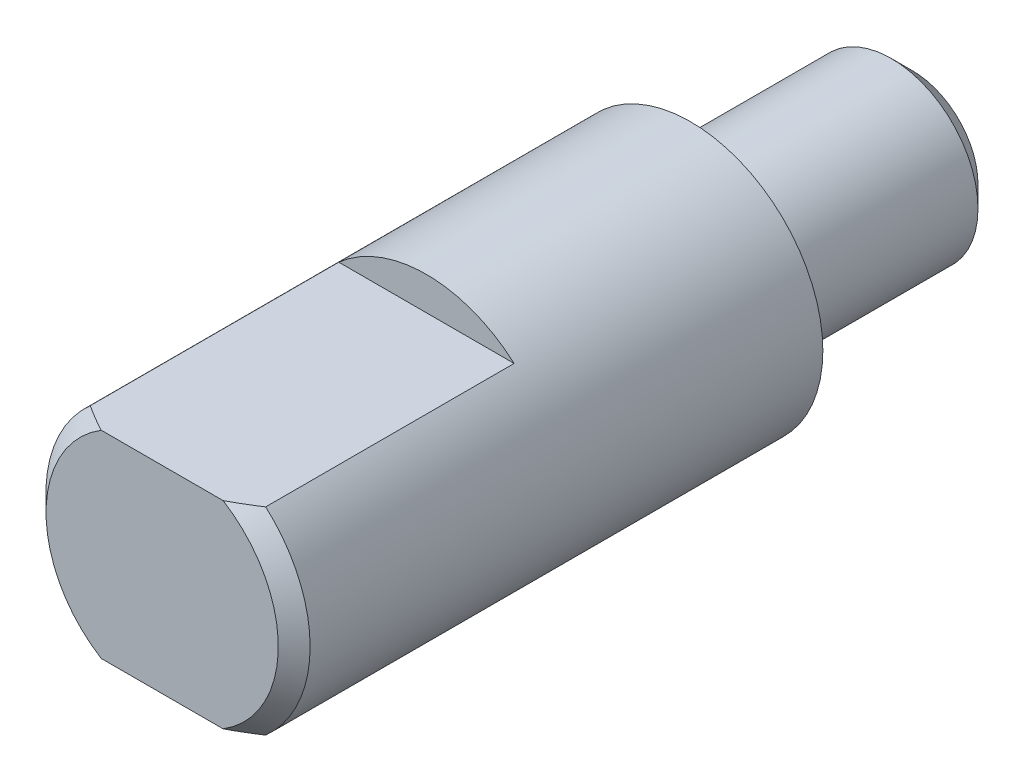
ISO-10303-21;
HEADER;
FILE_DESCRIPTION(('STEP AP214'),'2;1');
FILE_NAME('part.step','',(''),(''),'','','');
FILE_SCHEMA(('AUTOMOTIVE_DESIGN { 1 0 10303 214 1 1 1 1 }'));
ENDSEC;
DATA;
#1=APPLICATION_CONTEXT('core data for automotive mechanical design processes');
#2=APPLICATION_PROTOCOL_DEFINITION('international standard','automotive_design',2000,#1);
#3=PRODUCT_CONTEXT('',#1,'mechanical');
#4=PRODUCT('Part','Part','',(#3));
#5=PRODUCT_RELATED_PRODUCT_CATEGORY('part','',(#4));
#6=PRODUCT_DEFINITION_FORMATION('','',#4);
#7=PRODUCT_DEFINITION_CONTEXT('part definition',#1,'design');
#8=PRODUCT_DEFINITION('design','',#6,#7);
#9=PRODUCT_DEFINITION_SHAPE('','',#8);
#10=(LENGTH_UNIT() NAMED_UNIT(*) SI_UNIT(.MILLI.,.METRE.));
#11=(NAMED_UNIT(*) PLANE_ANGLE_UNIT() SI_UNIT($,.RADIAN.));
#12=(NAMED_UNIT(*) SI_UNIT($,.STERADIAN.) SOLID_ANGLE_UNIT());
#13=UNCERTAINTY_MEASURE_WITH_UNIT(LENGTH_MEASURE(1.E-05),#10,'distance_accuracy_value','');
#14=(GEOMETRIC_REPRESENTATION_CONTEXT(3) GLOBAL_UNCERTAINTY_ASSIGNED_CONTEXT((#13)) GLOBAL_UNIT_ASSIGNED_CONTEXT((#10,
#11,#12)) REPRESENTATION_CONTEXT('',''));
#15=CARTESIAN_POINT('',(0.,0.,0.));
#16=DIRECTION('',(0.,0.,1.));
#17=DIRECTION('',(1.,0.,0.));
#18=AXIS2_PLACEMENT_3D('',#15,#16,#17);
#19=CARTESIAN_POINT('',(0.,0.,3.684));
#20=DIRECTION('',(0.,0.,-1.));
#21=DIRECTION('',(-1.,0.,0.));
#22=AXIS2_PLACEMENT_3D('',#19,#20,#21);
#23=CONICAL_SURFACE('',#22,3.175,0.791934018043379);
#24=CARTESIAN_POINT('',(0.,0.,3.684));
#25=DIRECTION('',(0.,0.,1.));
#26=DIRECTION('',(1.,0.,0.));
#27=AXIS2_PLACEMENT_3D('',#24,#25,#26);
#28=CIRCLE('',#27,3.175);
#29=CARTESIAN_POINT('',(-2.10713075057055,2.375,3.684));
#30=VERTEX_POINT('',#29);
#31=CARTESIAN_POINT('',(-2.10713075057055,-2.375,3.684));
#32=VERTEX_POINT('',#31);
#33=EDGE_CURVE('E105',#30,#32,#28,.T.);
#34=ORIENTED_EDGE('',*,*,#33,.T.);
#35=CARTESIAN_POINT('',(-6.62966945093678,-2.375,-0.13301595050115));
#36=CARTESIAN_POINT('',(-6.41872085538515,-2.375,0.0629362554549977));
#37=CARTESIAN_POINT('',(-6.20729327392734,-2.375,0.258380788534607));
#38=CARTESIAN_POINT('',(-5.78286017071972,-2.375,0.64788739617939));
#39=CARTESIAN_POINT('',(-5.56985352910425,-2.375,0.841948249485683));
#40=CARTESIAN_POINT('',(-5.13574053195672,-2.375,1.23363349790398));
#41=CARTESIAN_POINT('',(-4.9145790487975,-2.375,1.43119690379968));
#42=CARTESIAN_POINT('',(-4.46963283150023,-2.375,1.82304516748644));
#43=CARTESIAN_POINT('',(-4.24585006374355,-2.375,2.01733224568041));
#44=CARTESIAN_POINT('',(-3.90719638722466,-2.375,2.30510248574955));
#45=CARTESIAN_POINT('',(-3.79385459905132,-2.375,2.40038380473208));
#46=CARTESIAN_POINT('',(-3.56590809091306,-2.375,2.5894215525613));
#47=CARTESIAN_POINT('',(-3.4513034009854,-2.375,2.68317801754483));
#48=CARTESIAN_POINT('',(-3.22025369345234,-2.375,2.86895465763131));
#49=CARTESIAN_POINT('',(-3.10380502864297,-2.375,2.96097030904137));
#50=CARTESIAN_POINT('',(-2.8689222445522,-2.375,3.14241965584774));
#51=CARTESIAN_POINT('',(-2.75048831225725,-2.375,3.23185359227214));
#52=CARTESIAN_POINT('',(-2.51255729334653,-2.375,3.40617108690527));
#53=CARTESIAN_POINT('',(-2.3930916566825,-2.375,3.49109735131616));
#54=CARTESIAN_POINT('',(-2.1509050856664,-2.375,3.65634247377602));
#55=CARTESIAN_POINT('',(-2.02818269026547,-2.375,3.73665921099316));
#56=CARTESIAN_POINT('',(-1.77912466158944,-2.375,3.89039659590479));
#57=CARTESIAN_POINT('',(-1.65280524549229,-2.375,3.96384327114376));
#58=CARTESIAN_POINT('',(-1.39512518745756,-2.375,4.10119391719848));
#59=CARTESIAN_POINT('',(-1.26377071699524,-2.375,4.16510912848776));
#60=CARTESIAN_POINT('',(-1.05701971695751,-2.375,4.25273595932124));
#61=CARTESIAN_POINT('',(-0.983728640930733,-2.375,4.28140199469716));
#62=CARTESIAN_POINT('',(-0.83535687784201,-2.375,4.3337772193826));
#63=CARTESIAN_POINT('',(-0.760275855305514,-2.375,4.35748547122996));
#64=CARTESIAN_POINT('',(-0.608898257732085,-2.375,4.39885359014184));
#65=CARTESIAN_POINT('',(-0.532610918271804,-2.375,4.41654679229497));
#66=CARTESIAN_POINT('',(-0.378780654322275,-2.375,4.445154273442));
#67=CARTESIAN_POINT('',(-0.301238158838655,-2.375,4.45607082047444));
#68=CARTESIAN_POINT('',(-0.144559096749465,-2.375,4.47054748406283));
#69=CARTESIAN_POINT('',(-0.0654144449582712,-2.375,4.47402190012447));
#70=CARTESIAN_POINT('',(0.0928249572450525,-2.375,4.47312081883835));
#71=CARTESIAN_POINT('',(0.171919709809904,-2.375,4.4687456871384));
#72=CARTESIAN_POINT('',(0.329626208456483,-2.375,4.45241265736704));
#73=CARTESIAN_POINT('',(0.408234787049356,-2.375,4.44042470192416));
#74=CARTESIAN_POINT('',(0.56408615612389,-2.375,4.40957980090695));
#75=CARTESIAN_POINT('',(0.641328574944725,-2.375,4.39072101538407));
#76=CARTESIAN_POINT('',(0.827865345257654,-2.375,4.33746225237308));
#77=CARTESIAN_POINT('',(0.936246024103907,-2.375,4.29987709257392));
#78=CARTESIAN_POINT('',(1.14927492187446,-2.375,4.21535984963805));
#79=CARTESIAN_POINT('',(1.25392057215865,-2.375,4.16842147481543));
#80=CARTESIAN_POINT('',(1.46087103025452,-2.375,4.06709514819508));
#81=CARTESIAN_POINT('',(1.56313950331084,-2.375,4.01263383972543));
#82=CARTESIAN_POINT('',(1.71427099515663,-2.375,3.92703840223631));
#83=CARTESIAN_POINT('',(1.76426245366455,-2.375,3.89786057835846));
#84=CARTESIAN_POINT('',(1.86356372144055,-2.375,3.83837009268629));
#85=CARTESIAN_POINT('',(1.91287355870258,-2.375,3.80805747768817));
#86=CARTESIAN_POINT('',(2.07522042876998,-2.375,3.70601224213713));
#87=CARTESIAN_POINT('',(2.18692206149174,-2.375,3.63215349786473));
#88=CARTESIAN_POINT('',(2.40772318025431,-2.375,3.48062951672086));
#89=CARTESIAN_POINT('',(2.5168220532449,-2.375,3.40296339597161));
#90=CARTESIAN_POINT('',(2.73301390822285,-2.375,3.24473477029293));
#91=CARTESIAN_POINT('',(2.84010537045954,-2.375,3.16417019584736));
#92=CARTESIAN_POINT('',(3.05261723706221,-2.375,3.00086187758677));
#93=CARTESIAN_POINT('',(3.15803753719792,-2.375,2.9181179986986));
#94=CARTESIAN_POINT('',(3.47300086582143,-2.375,2.6667998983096));
#95=CARTESIAN_POINT('',(3.68051445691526,-2.375,2.49568568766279));
#96=CARTESIAN_POINT('',(4.09182405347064,-2.375,2.14926116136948));
#97=CARTESIAN_POINT('',(4.29562161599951,-2.375,1.97395267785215));
#98=CARTESIAN_POINT('',(4.67931232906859,-2.375,1.63905531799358));
#99=CARTESIAN_POINT('',(4.85946034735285,-2.375,1.47975783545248));
#100=CARTESIAN_POINT('',(5.21824582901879,-2.375,1.15942835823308));
#101=CARTESIAN_POINT('',(5.39688309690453,-2.375,0.998396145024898));
#102=CARTESIAN_POINT('',(5.75173692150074,-2.375,0.676174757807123));
#103=CARTESIAN_POINT('',(5.92796166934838,-2.375,0.514994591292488));
#104=CARTESIAN_POINT('',(6.27946145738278,-2.375,0.191659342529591));
#105=CARTESIAN_POINT('',(6.45473664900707,-2.375,0.0295044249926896));
#106=CARTESIAN_POINT('',(6.62966945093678,-2.375,-0.13301595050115));
#107=B_SPLINE_CURVE_WITH_KNOTS('',3,(#35,#36,#37,#38,#39,#40,#41,#42,#43,#44,#45,#46,#47,#48,
#49,#50,#51,#52,#53,#54,#55,#56,#57,#58,#59,#60,#61,#62,#63,#64,#65,#66,#67,#68,#69,#70,#71,#72,
#73,#74,#75,#76,#77,#78,#79,#80,#81,#82,#83,#84,#85,#86,#87,#88,#89,#90,#91,#92,#93,#94,#95,#96,
#97,#98,#99,#100,#101,#102,#103,#104,#105,#106),.UNSPECIFIED.,.F.,.F.,(4,2,2,2,2,2,2,2,2,2,2,2,
2,2,2,2,2,2,2,2,2,2,2,2,2,2,2,2,2,2,2,2,2,2,2,4),(0.,0.863760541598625,1.72820709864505,
2.61784876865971,3.50686109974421,3.95106286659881,4.39525409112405,4.84047397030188,
5.28565214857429,5.72530383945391,6.16515621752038,6.60326828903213,7.04085953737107,
7.2768120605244,7.51280915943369,7.74747620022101,7.98206465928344,8.21934033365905,
8.45660495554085,8.69481223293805,8.93308334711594,9.27660606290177,9.62036064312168,
9.96774119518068,10.1413805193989,10.3150126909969,10.7166254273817,11.1183318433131,
11.5203310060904,11.9223551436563,12.7291420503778,13.5355827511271,14.2569976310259,
14.9785044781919,15.6949553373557,16.4112883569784),.UNSPECIFIED.);
#108=CARTESIAN_POINT('',(-1.46406113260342,-2.375,4.064));
#109=VERTEX_POINT('',#108);
#110=EDGE_CURVE('E128',#32,#109,#107,.T.);
#111=ORIENTED_EDGE('',*,*,#110,.T.);
#112=CARTESIAN_POINT('',(0.,0.,4.064));
#113=DIRECTION('',(0.,0.,1.));
#114=DIRECTION('',(1.,0.,0.));
#115=AXIS2_PLACEMENT_3D('',#112,#113,#114);
#116=CIRCLE('',#115,2.79);
#117=CARTESIAN_POINT('',(-1.46406113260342,2.375,4.064));
#118=VERTEX_POINT('',#117);
#119=EDGE_CURVE('E115',#118,#109,#116,.T.);
#120=ORIENTED_EDGE('',*,*,#119,.F.);
#121=CARTESIAN_POINT('',(6.62966945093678,2.375,-0.13301595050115));
#122=CARTESIAN_POINT('',(6.41872085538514,2.375,0.0629362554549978));
#123=CARTESIAN_POINT('',(6.20729327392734,2.375,0.258380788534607));
#124=CARTESIAN_POINT('',(5.78286017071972,2.375,0.64788739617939));
#125=CARTESIAN_POINT('',(5.56985352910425,2.375,0.841948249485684));
#126=CARTESIAN_POINT('',(5.13574053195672,2.375,1.23363349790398));
#127=CARTESIAN_POINT('',(4.9145790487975,2.375,1.43119690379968));
#128=CARTESIAN_POINT('',(4.46963283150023,2.375,1.82304516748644));
#129=CARTESIAN_POINT('',(4.24585006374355,2.375,2.01733224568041));
#130=CARTESIAN_POINT('',(3.90719638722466,2.375,2.30510248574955));
#131=CARTESIAN_POINT('',(3.79385459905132,2.375,2.40038380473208));
#132=CARTESIAN_POINT('',(3.56590809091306,2.375,2.5894215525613));
#133=CARTESIAN_POINT('',(3.4513034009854,2.375,2.68317801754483));
#134=CARTESIAN_POINT('',(3.22025369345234,2.375,2.86895465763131));
#135=CARTESIAN_POINT('',(3.10380502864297,2.375,2.96097030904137));
#136=CARTESIAN_POINT('',(2.8689222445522,2.375,3.14241965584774));
#137=CARTESIAN_POINT('',(2.75048831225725,2.375,3.23185359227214));
#138=CARTESIAN_POINT('',(2.51255729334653,2.375,3.40617108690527));
#139=CARTESIAN_POINT('',(2.3930916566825,2.375,3.49109735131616));
#140=CARTESIAN_POINT('',(2.1509050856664,2.375,3.65634247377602));
#141=CARTESIAN_POINT('',(2.02818269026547,2.375,3.73665921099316));
#142=CARTESIAN_POINT('',(1.77912466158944,2.375,3.89039659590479));
#143=CARTESIAN_POINT('',(1.65280524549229,2.375,3.96384327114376));
#144=CARTESIAN_POINT('',(1.39512518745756,2.375,4.10119391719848));
#145=CARTESIAN_POINT('',(1.26377071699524,2.375,4.16510912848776));
#146=CARTESIAN_POINT('',(1.05701971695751,2.375,4.25273595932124));
#147=CARTESIAN_POINT('',(0.983728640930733,2.375,4.28140199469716));
#148=CARTESIAN_POINT('',(0.83535687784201,2.375,4.3337772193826));
#149=CARTESIAN_POINT('',(0.760275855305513,2.375,4.35748547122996));
#150=CARTESIAN_POINT('',(0.608898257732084,2.375,4.39885359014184));
#151=CARTESIAN_POINT('',(0.532610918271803,2.375,4.41654679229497));
#152=CARTESIAN_POINT('',(0.378780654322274,2.375,4.445154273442));
#153=CARTESIAN_POINT('',(0.301238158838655,2.375,4.45607082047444));
#154=CARTESIAN_POINT('',(0.144559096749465,2.375,4.47054748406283));
#155=CARTESIAN_POINT('',(0.0654144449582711,2.375,4.47402190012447));
#156=CARTESIAN_POINT('',(-0.0928249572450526,2.375,4.47312081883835));
#157=CARTESIAN_POINT('',(-0.171919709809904,2.375,4.4687456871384));
#158=CARTESIAN_POINT('',(-0.329626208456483,2.375,4.45241265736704));
#159=CARTESIAN_POINT('',(-0.408234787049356,2.375,4.44042470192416));
#160=CARTESIAN_POINT('',(-0.56408615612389,2.375,4.40957980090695));
#161=CARTESIAN_POINT('',(-0.641328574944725,2.375,4.39072101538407));
#162=CARTESIAN_POINT('',(-0.827865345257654,2.375,4.33746225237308));
#163=CARTESIAN_POINT('',(-0.936246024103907,2.375,4.29987709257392));
#164=CARTESIAN_POINT('',(-1.14927492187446,2.375,4.21535984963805));
#165=CARTESIAN_POINT('',(-1.25392057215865,2.375,4.16842147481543));
#166=CARTESIAN_POINT('',(-1.46087103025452,2.375,4.06709514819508));
#167=CARTESIAN_POINT('',(-1.56313950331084,2.375,4.01263383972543));
#168=CARTESIAN_POINT('',(-1.71427099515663,2.375,3.92703840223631));
#169=CARTESIAN_POINT('',(-1.76426245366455,2.375,3.89786057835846));
#170=CARTESIAN_POINT('',(-1.86356372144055,2.375,3.83837009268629));
#171=CARTESIAN_POINT('',(-1.91287355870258,2.375,3.80805747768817));
#172=CARTESIAN_POINT('',(-2.07522042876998,2.375,3.70601224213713));
#173=CARTESIAN_POINT('',(-2.18692206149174,2.375,3.63215349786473));
#174=CARTESIAN_POINT('',(-2.40772318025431,2.375,3.48062951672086));
#175=CARTESIAN_POINT('',(-2.51682205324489,2.375,3.40296339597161));
#176=CARTESIAN_POINT('',(-2.73301390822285,2.375,3.24473477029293));
#177=CARTESIAN_POINT('',(-2.84010537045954,2.375,3.16417019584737));
#178=CARTESIAN_POINT('',(-3.05261723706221,2.375,3.00086187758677));
#179=CARTESIAN_POINT('',(-3.15803753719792,2.375,2.91811799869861));
#180=CARTESIAN_POINT('',(-3.47300086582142,2.375,2.66679989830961));
#181=CARTESIAN_POINT('',(-3.68051445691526,2.375,2.49568568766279));
#182=CARTESIAN_POINT('',(-4.09182405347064,2.375,2.14926116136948));
#183=CARTESIAN_POINT('',(-4.29562161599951,2.375,1.97395267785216));
#184=CARTESIAN_POINT('',(-4.67931232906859,2.375,1.63905531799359));
#185=CARTESIAN_POINT('',(-4.85946034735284,2.375,1.47975783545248));
#186=CARTESIAN_POINT('',(-5.21824582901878,2.375,1.15942835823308));
#187=CARTESIAN_POINT('',(-5.39688309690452,2.375,0.998396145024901));
#188=CARTESIAN_POINT('',(-5.75173692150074,2.375,0.676174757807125));
#189=CARTESIAN_POINT('',(-5.92796166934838,2.375,0.514994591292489));
#190=CARTESIAN_POINT('',(-6.27946145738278,2.375,0.191659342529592));
#191=CARTESIAN_POINT('',(-6.45473664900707,2.375,0.0295044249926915));
#192=CARTESIAN_POINT('',(-6.62966945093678,2.375,-0.13301595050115));
#193=B_SPLINE_CURVE_WITH_KNOTS('',3,(#121,#122,#123,#124,#125,#126,#127,#128,#129,#130,#131,
#132,#133,#134,#135,#136,#137,#138,#139,#140,#141,#142,#143,#144,#145,#146,#147,#148,#149,#150,
#151,#152,#153,#154,#155,#156,#157,#158,#159,#160,#161,#162,#163,#164,#165,#166,#167,#168,#169,
#170,#171,#172,#173,#174,#175,#176,#177,#178,#179,#180,#181,#182,#183,#184,#185,#186,#187,#188,
#189,#190,#191,#192),.UNSPECIFIED.,.F.,.F.,(4,2,2,2,2,2,2,2,2,2,2,2,2,2,2,2,2,2,2,2,2,2,2,2,2,2,
2,2,2,2,2,2,2,2,2,4),(0.,0.863760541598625,1.72820709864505,2.61784876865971,3.50686109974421,
3.95106286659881,4.39525409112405,4.84047397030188,5.28565214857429,5.72530383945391,
6.16515621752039,6.60326828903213,7.04085953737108,7.2768120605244,7.51280915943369,
7.74747620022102,7.98206465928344,8.21934033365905,8.45660495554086,8.69481223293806,
8.93308334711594,9.27660606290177,9.62036064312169,9.96774119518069,10.1413805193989,
10.3150126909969,10.7166254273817,11.1183318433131,11.5203310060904,11.9223551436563,
12.7291420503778,13.5355827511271,14.2569976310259,14.9785044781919,15.6949553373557,
16.4112883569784),.UNSPECIFIED.);
#194=EDGE_CURVE('E129',#118,#30,#193,.T.);
#195=ORIENTED_EDGE('',*,*,#194,.T.);
#196=EDGE_LOOP('',(#34,#111,#120,#195));
#197=FACE_BOUND('',#196,.T.);
#198=ADVANCED_FACE('F33',(#197),#23,.T.);
#199=CARTESIAN_POINT('',(0.,0.,4.064));
#200=DIRECTION('',(0.,0.,-1.));
#201=DIRECTION('',(-1.,0.,0.));
#202=AXIS2_PLACEMENT_3D('',#199,#200,#201);
#203=PLANE('',#202);
#204=ORIENTED_EDGE('',*,*,#119,.T.);
#205=DIRECTION('',(1.,0.,0.));
#206=VECTOR('',#205,1.);
#207=CARTESIAN_POINT('',(-5.,-2.375,4.064));
#208=LINE('',#207,#206);
#209=CARTESIAN_POINT('',(1.46406113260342,-2.375,4.064));
#210=VERTEX_POINT('',#209);
#211=EDGE_CURVE('E95',#109,#210,#208,.T.);
#212=ORIENTED_EDGE('',*,*,#211,.T.);
#213=CARTESIAN_POINT('',(1.46406113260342,2.375,4.064));
#214=VERTEX_POINT('',#213);
#215=EDGE_CURVE('E109',#210,#214,#116,.T.);
#216=ORIENTED_EDGE('',*,*,#215,.T.);
#217=DIRECTION('',(1.,0.,0.));
#218=VECTOR('',#217,1.);
#219=CARTESIAN_POINT('',(-5.,2.375,4.064));
#220=LINE('',#219,#218);
#221=EDGE_CURVE('E135',#118,#214,#220,.T.);
#222=ORIENTED_EDGE('',*,*,#221,.F.);
#223=EDGE_LOOP('',(#204,#212,#216,#222));
#224=FACE_BOUND('',#223,.T.);
#225=ADVANCED_FACE('F35',(#224),#203,.F.);
#226=ORIENTED_EDGE('',*,*,#215,.F.);
#227=CARTESIAN_POINT('',(2.10713075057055,-2.375,3.684));
#228=VERTEX_POINT('',#227);
#229=EDGE_CURVE('E94',#210,#228,#107,.T.);
#230=ORIENTED_EDGE('',*,*,#229,.T.);
#231=CARTESIAN_POINT('',(2.10713075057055,2.375,3.684));
#232=VERTEX_POINT('',#231);
#233=EDGE_CURVE('E101',#228,#232,#28,.T.);
#234=ORIENTED_EDGE('',*,*,#233,.T.);
#235=EDGE_CURVE('E132',#232,#214,#193,.T.);
#236=ORIENTED_EDGE('',*,*,#235,.T.);
#237=EDGE_LOOP('',(#226,#230,#234,#236));
#238=FACE_BOUND('',#237,.T.);
#239=ADVANCED_FACE('F144',(#238),#23,.T.);
#240=CARTESIAN_POINT('',(0.,0.,4.064));
#241=DIRECTION('',(0.,0.,1.));
#242=DIRECTION('',(1.,0.,0.));
#243=AXIS2_PLACEMENT_3D('',#240,#241,#242);
#244=CYLINDRICAL_SURFACE('',#243,3.175);
#245=ORIENTED_EDGE('',*,*,#233,.F.);
#246=DIRECTION('',(0.,0.,1.));
#247=VECTOR('',#246,1.);
#248=CARTESIAN_POINT('',(2.10713075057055,-2.375,4.064));
#249=LINE('',#248,#247);
#250=CARTESIAN_POINT('',(2.10713075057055,-2.375,-2.286));
#251=VERTEX_POINT('',#250);
#252=EDGE_CURVE('E11',#228,#251,#249,.F.);
#253=ORIENTED_EDGE('',*,*,#252,.T.);
#254=CARTESIAN_POINT('',(0.,0.,-2.286));
#255=DIRECTION('',(0.,0.,-1.));
#256=DIRECTION('',(-1.,0.,0.));
#257=AXIS2_PLACEMENT_3D('',#254,#255,#256);
#258=CIRCLE('',#257,3.175);
#259=CARTESIAN_POINT('',(-2.10713075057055,-2.375,-2.286));
#260=VERTEX_POINT('',#259);
#261=EDGE_CURVE('E85',#251,#260,#258,.T.);
#262=ORIENTED_EDGE('',*,*,#261,.T.);
#263=DIRECTION('',(0.,0.,1.));
#264=VECTOR('',#263,1.);
#265=CARTESIAN_POINT('',(-2.10713075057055,-2.375,4.064));
#266=LINE('',#265,#264);
#267=EDGE_CURVE('E41',#260,#32,#266,.T.);
#268=ORIENTED_EDGE('',*,*,#267,.T.);
#269=ORIENTED_EDGE('',*,*,#33,.F.);
#270=DIRECTION('',(0.,0.,1.));
#271=VECTOR('',#270,1.);
#272=CARTESIAN_POINT('',(-2.10713075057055,2.375,4.064));
#273=LINE('',#272,#271);
#274=CARTESIAN_POINT('',(-2.10713075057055,2.375,-2.286));
#275=VERTEX_POINT('',#274);
#276=EDGE_CURVE('E118',#30,#275,#273,.F.);
#277=ORIENTED_EDGE('',*,*,#276,.T.);
#278=CARTESIAN_POINT('',(0.,0.,-2.286));
#279=DIRECTION('',(0.,0.,-1.));
#280=DIRECTION('',(-1.,0.,0.));
#281=AXIS2_PLACEMENT_3D('',#278,#279,#280);
#282=CIRCLE('',#281,3.175);
#283=CARTESIAN_POINT('',(2.10713075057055,2.375,-2.286));
#284=VERTEX_POINT('',#283);
#285=EDGE_CURVE('E121',#275,#284,#282,.T.);
#286=ORIENTED_EDGE('',*,*,#285,.T.);
#287=DIRECTION('',(0.,0.,1.));
#288=VECTOR('',#287,1.);
#289=CARTESIAN_POINT('',(2.10713075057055,2.375,4.064));
#290=LINE('',#289,#288);
#291=EDGE_CURVE('E89',#284,#232,#290,.T.);
#292=ORIENTED_EDGE('',*,*,#291,.T.);
#293=EDGE_LOOP('',(#245,#253,#262,#268,#269,#277,#286,#292));
#294=FACE_BOUND('',#293,.T.);
#295=CARTESIAN_POINT('',(0.,0.,-8.636));
#296=DIRECTION('',(0.,0.,1.));
#297=DIRECTION('',(1.,0.,0.));
#298=AXIS2_PLACEMENT_3D('',#295,#296,#297);
#299=CIRCLE('',#298,3.175);
#300=CARTESIAN_POINT('',(3.175,0.,-8.636));
#301=VERTEX_POINT('',#300);
#302=EDGE_CURVE('E106',#301,#301,#299,.T.);
#303=ORIENTED_EDGE('',*,*,#302,.T.);
#304=EDGE_LOOP('',(#303));
#305=FACE_BOUND('',#304,.T.);
#306=ADVANCED_FACE('F98',(#294,#305),#244,.T.);
#307=CARTESIAN_POINT('',(0.,2.0828,-8.636));
#308=DIRECTION('',(0.,0.,1.));
#309=DIRECTION('',(1.,0.,0.));
#310=AXIS2_PLACEMENT_3D('',#307,#308,#309);
#311=PLANE('',#310);
#312=ORIENTED_EDGE('',*,*,#302,.F.);
#313=EDGE_LOOP('',(#312));
#314=FACE_BOUND('',#313,.T.);
#315=CARTESIAN_POINT('',(0.,0.,-8.636));
#316=DIRECTION('',(0.,0.,1.));
#317=DIRECTION('',(1.,0.,0.));
#318=AXIS2_PLACEMENT_3D('',#315,#316,#317);
#319=CIRCLE('',#318,2.0828);
#320=CARTESIAN_POINT('',(2.0828,0.,-8.636));
#321=VERTEX_POINT('',#320);
#322=EDGE_CURVE('E111',#321,#321,#319,.T.);
#323=ORIENTED_EDGE('',*,*,#322,.T.);
#324=EDGE_LOOP('',(#323));
#325=FACE_BOUND('',#324,.T.);
#326=ADVANCED_FACE('F165',(#314,#325),#311,.F.);
#327=CARTESIAN_POINT('',(0.,0.,4.064));
#328=DIRECTION('',(0.,0.,1.));
#329=DIRECTION('',(1.,0.,0.));
#330=AXIS2_PLACEMENT_3D('',#327,#328,#329);
#331=CYLINDRICAL_SURFACE('',#330,2.0828);
#332=ORIENTED_EDGE('',*,*,#322,.F.);
#333=EDGE_LOOP('',(#332));
#334=FACE_BOUND('',#333,.T.);
#335=CARTESIAN_POINT('',(0.,0.,-13.456));
#336=DIRECTION('',(0.,0.,1.));
#337=DIRECTION('',(1.,0.,0.));
#338=AXIS2_PLACEMENT_3D('',#335,#336,#337);
#339=CIRCLE('',#338,2.0828);
#340=CARTESIAN_POINT('',(2.0828,0.,-13.456));
#341=VERTEX_POINT('',#340);
#342=EDGE_CURVE('E263',#341,#341,#339,.T.);
#343=ORIENTED_EDGE('',*,*,#342,.T.);
#344=EDGE_LOOP('',(#343));
#345=FACE_BOUND('',#344,.T.);
#346=ADVANCED_FACE('F161',(#334,#345),#331,.T.);
#347=CARTESIAN_POINT('',(0.,0.,-13.966));
#348=DIRECTION('',(0.,0.,1.));
#349=DIRECTION('',(1.,0.,0.));
#350=AXIS2_PLACEMENT_3D('',#347,#348,#349);
#351=CONICAL_SURFACE('',#350,1.57280000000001,0.785398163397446);
#352=ORIENTED_EDGE('',*,*,#342,.F.);
#353=EDGE_LOOP('',(#352));
#354=FACE_BOUND('',#353,.T.);
#355=CARTESIAN_POINT('',(0.,0.,-13.966));
#356=DIRECTION('',(0.,0.,1.));
#357=DIRECTION('',(1.,0.,0.));
#358=AXIS2_PLACEMENT_3D('',#355,#356,#357);
#359=CIRCLE('',#358,1.57280000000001);
#360=CARTESIAN_POINT('',(1.57280000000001,0.,-13.966));
#361=VERTEX_POINT('',#360);
#362=EDGE_CURVE('E134',#361,#361,#359,.T.);
#363=ORIENTED_EDGE('',*,*,#362,.T.);
#364=EDGE_LOOP('',(#363));
#365=FACE_BOUND('',#364,.T.);
#366=ADVANCED_FACE('F157',(#354,#365),#351,.T.);
#367=CARTESIAN_POINT('',(0.,0.,-13.966));
#368=DIRECTION('',(0.,0.,1.));
#369=DIRECTION('',(1.,0.,0.));
#370=AXIS2_PLACEMENT_3D('',#367,#368,#369);
#371=PLANE('',#370);
#372=ORIENTED_EDGE('',*,*,#362,.F.);
#373=EDGE_LOOP('',(#372));
#374=FACE_BOUND('',#373,.T.);
#375=ADVANCED_FACE('F154',(#374),#371,.F.);
#376=CARTESIAN_POINT('',(-5.,2.375,-2.286));
#377=DIRECTION('',(0.,0.,-1.));
#378=DIRECTION('',(-1.,0.,0.));
#379=AXIS2_PLACEMENT_3D('',#376,#377,#378);
#380=PLANE('',#379);
#381=DIRECTION('',(1.,0.,0.));
#382=VECTOR('',#381,1.);
#383=CARTESIAN_POINT('',(-5.,2.375,-2.286));
#384=LINE('',#383,#382);
#385=EDGE_CURVE('E55',#275,#284,#384,.T.);
#386=ORIENTED_EDGE('',*,*,#385,.T.);
#387=ORIENTED_EDGE('',*,*,#285,.F.);
#388=EDGE_LOOP('',(#386,#387));
#389=FACE_BOUND('',#388,.T.);
#390=ADVANCED_FACE('F152',(#389),#380,.F.);
#391=CARTESIAN_POINT('',(-5.,2.375,4.064));
#392=DIRECTION('',(0.,-1.,0.));
#393=DIRECTION('',(0.,0.,-1.));
#394=AXIS2_PLACEMENT_3D('',#391,#392,#393);
#395=PLANE('',#394);
#396=ORIENTED_EDGE('',*,*,#291,.F.);
#397=ORIENTED_EDGE('',*,*,#385,.F.);
#398=ORIENTED_EDGE('',*,*,#276,.F.);
#399=ORIENTED_EDGE('',*,*,#194,.F.);
#400=ORIENTED_EDGE('',*,*,#221,.T.);
#401=ORIENTED_EDGE('',*,*,#235,.F.);
#402=EDGE_LOOP('',(#396,#397,#398,#399,#400,#401));
#403=FACE_BOUND('',#402,.T.);
#404=ADVANCED_FACE('F147',(#403),#395,.F.);
#405=CARTESIAN_POINT('',(-5.,-2.375,4.064));
#406=DIRECTION('',(0.,1.,0.));
#407=DIRECTION('',(0.,0.,1.));
#408=AXIS2_PLACEMENT_3D('',#405,#406,#407);
#409=PLANE('',#408);
#410=ORIENTED_EDGE('',*,*,#267,.F.);
#411=DIRECTION('',(1.,0.,0.));
#412=VECTOR('',#411,1.);
#413=CARTESIAN_POINT('',(-5.,-2.375,-2.286));
#414=LINE('',#413,#412);
#415=EDGE_CURVE('E47',#260,#251,#414,.T.);
#416=ORIENTED_EDGE('',*,*,#415,.T.);
#417=ORIENTED_EDGE('',*,*,#252,.F.);
#418=ORIENTED_EDGE('',*,*,#229,.F.);
#419=ORIENTED_EDGE('',*,*,#211,.F.);
#420=ORIENTED_EDGE('',*,*,#110,.F.);
#421=EDGE_LOOP('',(#410,#416,#417,#418,#419,#420));
#422=FACE_BOUND('',#421,.T.);
#423=ADVANCED_FACE('F92',(#422),#409,.F.);
#424=CARTESIAN_POINT('',(-5.,-2.375,-2.286));
#425=DIRECTION('',(0.,0.,-1.));
#426=DIRECTION('',(-1.,0.,0.));
#427=AXIS2_PLACEMENT_3D('',#424,#425,#426);
#428=PLANE('',#427);
#429=ORIENTED_EDGE('',*,*,#415,.F.);
#430=ORIENTED_EDGE('',*,*,#261,.F.);
#431=EDGE_LOOP('',(#429,#430));
#432=FACE_BOUND('',#431,.T.);
#433=ADVANCED_FACE('F86',(#432),#428,.F.);
#434=CLOSED_SHELL('',(#198,#225,#239,#306,#326,#346,#366,#375,#390,#404,#423,#433));
#435=MANIFOLD_SOLID_BREP('B2',#434);
#436=ADVANCED_BREP_SHAPE_REPRESENTATION('',(#18,#435),#14);
#437=SHAPE_DEFINITION_REPRESENTATION(#9,#436);
ENDSEC;
END-ISO-10303-21;
